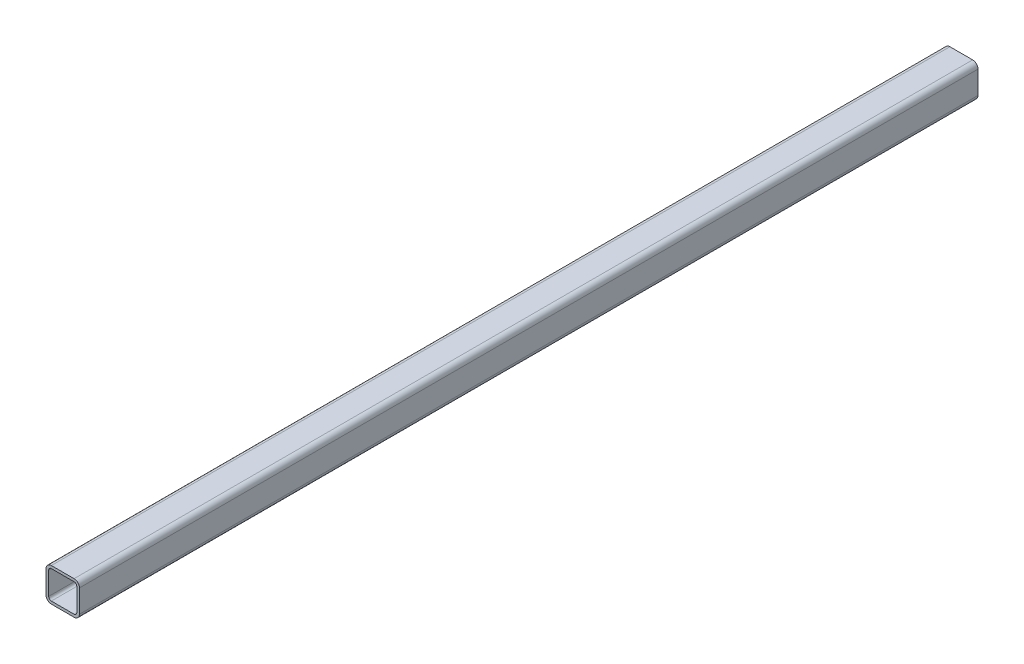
from build123d import *

# Parameters (mm, degrees)
EXTRUDE_THIN1_DEPTH = 511.96875


with BuildPart() as part:
    # Sketch1 → Extrude-Thin1 (new, symmetric)
    with BuildSketch(Plane.XY):
        with BuildLine():
            Line((-19.05, -12.97432), (-19.05, 12.97432))
            ThreePointArc((-19.05, 12.97432), (-17.270474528, 17.270474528), (-12.97432, 19.05))
            Line((-12.97432, 19.05), (12.97432, 19.05))
            ThreePointArc((12.97432, 19.05), (17.270474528, 17.270474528), (19.05, 12.97432))
            Line((19.05, 12.97432), (19.05, -12.97432))
            ThreePointArc((19.05, -12.97432), (17.270474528, -17.270474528), (12.97432, -19.05))
            Line((12.97432, -19.05), (-12.97432, -19.05))
            ThreePointArc((-12.97432, -19.05), (-17.270474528, -17.270474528), (-19.05, -12.97432))
        make_face()
        with BuildLine():
            Line((-16.01216, -12.97432), (-16.01216, 12.97432))
            ThreePointArc((-16.01216, 12.97432), (-15.122397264, 15.122397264), (-12.97432, 16.01216))
            Line((-12.97432, 16.01216), (12.97432, 16.01216))
            ThreePointArc((12.97432, 16.01216), (15.122397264, 15.122397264), (16.01216, 12.97432))
            Line((16.01216, 12.97432), (16.01216, -12.97432))
            ThreePointArc((16.01216, -12.97432), (15.122397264, -15.122397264), (12.97432, -16.01216))
            Line((12.97432, -16.01216), (-12.97432, -16.01216))
            ThreePointArc((-12.97432, -16.01216), (-15.122397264, -15.122397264), (-16.01216, -12.97432))
        make_face(mode=Mode.SUBTRACT)
    extrude(amount=EXTRUDE_THIN1_DEPTH, both=True)


solid = part.part
